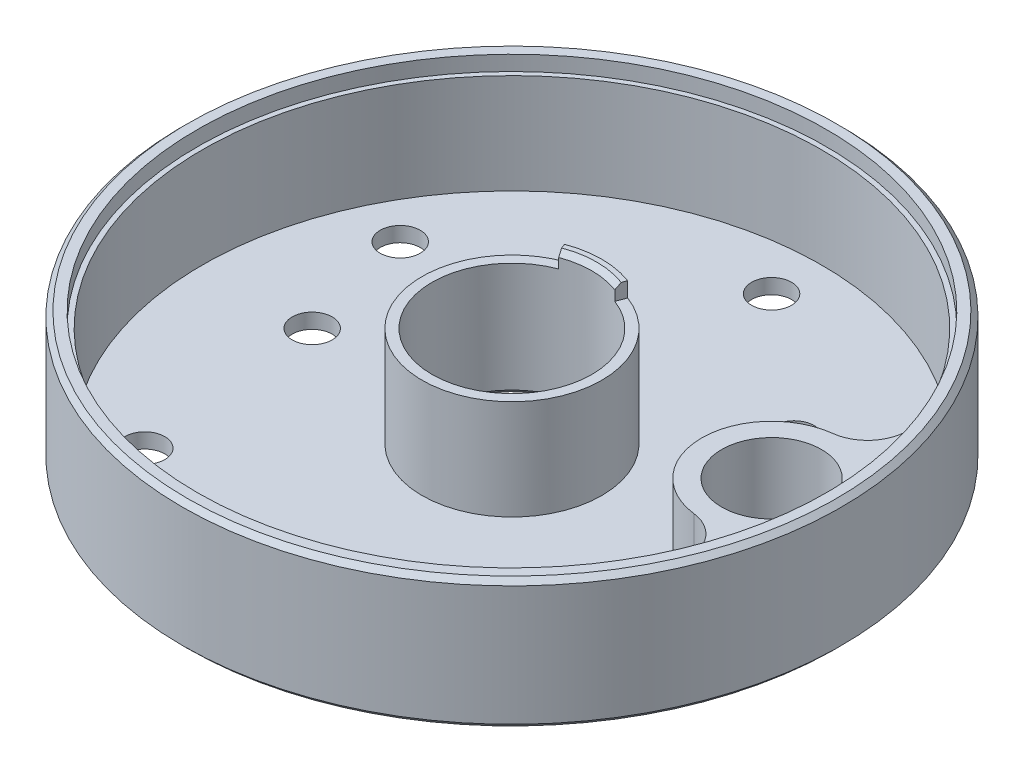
ISO-10303-21;
HEADER;
FILE_DESCRIPTION(('STEP AP214'),'2;1');
FILE_NAME('part.step','',(''),(''),'','','');
FILE_SCHEMA(('AUTOMOTIVE_DESIGN { 1 0 10303 214 1 1 1 1 }'));
ENDSEC;
DATA;
#1=APPLICATION_CONTEXT('core data for automotive mechanical design processes');
#2=APPLICATION_PROTOCOL_DEFINITION('international standard','automotive_design',2000,#1);
#3=PRODUCT_CONTEXT('',#1,'mechanical');
#4=PRODUCT('Part','Part','',(#3));
#5=PRODUCT_RELATED_PRODUCT_CATEGORY('part','',(#4));
#6=PRODUCT_DEFINITION_FORMATION('','',#4);
#7=PRODUCT_DEFINITION_CONTEXT('part definition',#1,'design');
#8=PRODUCT_DEFINITION('design','',#6,#7);
#9=PRODUCT_DEFINITION_SHAPE('','',#8);
#10=(LENGTH_UNIT() NAMED_UNIT(*) SI_UNIT(.MILLI.,.METRE.));
#11=(NAMED_UNIT(*) PLANE_ANGLE_UNIT() SI_UNIT($,.RADIAN.));
#12=(NAMED_UNIT(*) SI_UNIT($,.STERADIAN.) SOLID_ANGLE_UNIT());
#13=UNCERTAINTY_MEASURE_WITH_UNIT(LENGTH_MEASURE(1.E-05),#10,'distance_accuracy_value','');
#14=(GEOMETRIC_REPRESENTATION_CONTEXT(3) GLOBAL_UNCERTAINTY_ASSIGNED_CONTEXT((#13)) GLOBAL_UNIT_ASSIGNED_CONTEXT((#10,
#11,#12)) REPRESENTATION_CONTEXT('',''));
#15=CARTESIAN_POINT('',(0.,0.,0.));
#16=DIRECTION('',(0.,0.,1.));
#17=DIRECTION('',(1.,0.,0.));
#18=AXIS2_PLACEMENT_3D('',#15,#16,#17);
#19=CARTESIAN_POINT('',(0.,-1.5,0.));
#20=DIRECTION('',(0.,1.,0.));
#21=DIRECTION('',(0.,0.,1.));
#22=AXIS2_PLACEMENT_3D('',#19,#20,#21);
#23=PLANE('',#22);
#24=DIRECTION('',(0.351123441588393,0.,0.936329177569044));
#25=VECTOR('',#24,1.);
#26=CARTESIAN_POINT('',(-3.,-1.5,-8.));
#27=LINE('',#26,#25);
#28=CARTESIAN_POINT('',(-3.16011097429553,-1.5,-8.4269625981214));
#29=VERTEX_POINT('',#28);
#30=CARTESIAN_POINT('',(-2.80898753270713,-1.5,-7.49063342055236));
#31=VERTEX_POINT('',#30);
#32=EDGE_CURVE('E163',#29,#31,#27,.T.);
#33=ORIENTED_EDGE('',*,*,#32,.F.);
#34=CARTESIAN_POINT('',(0.,-1.5,0.));
#35=DIRECTION('',(0.,1.,0.));
#36=DIRECTION('',(0.,0.,1.));
#37=AXIS2_PLACEMENT_3D('',#34,#35,#36);
#38=CIRCLE('',#37,9.);
#39=CARTESIAN_POINT('',(3.16011097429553,-1.5,-8.4269625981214));
#40=VERTEX_POINT('',#39);
#41=EDGE_CURVE('E137',#29,#40,#38,.T.);
#42=ORIENTED_EDGE('',*,*,#41,.T.);
#43=DIRECTION('',(0.351123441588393,0.,-0.936329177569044));
#44=VECTOR('',#43,1.);
#45=CARTESIAN_POINT('',(3.,-1.5,-8.));
#46=LINE('',#45,#44);
#47=CARTESIAN_POINT('',(2.80898753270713,-1.5,-7.49063342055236));
#48=VERTEX_POINT('',#47);
#49=EDGE_CURVE('E160',#48,#40,#46,.T.);
#50=ORIENTED_EDGE('',*,*,#49,.F.);
#51=CARTESIAN_POINT('',(0.,-1.5,0.));
#52=DIRECTION('',(0.,1.,0.));
#53=DIRECTION('',(0.,0.,1.));
#54=AXIS2_PLACEMENT_3D('',#51,#52,#53);
#55=CIRCLE('',#54,8.);
#56=EDGE_CURVE('E166',#31,#48,#55,.T.);
#57=ORIENTED_EDGE('',*,*,#56,.F.);
#58=EDGE_LOOP('',(#33,#42,#50,#57));
#59=FACE_BOUND('',#58,.T.);
#60=ADVANCED_FACE('F32',(#59),#23,.T.);
#61=CARTESIAN_POINT('',(0.,0.,0.));
#62=DIRECTION('',(0.,1.,0.));
#63=DIRECTION('',(0.,0.,1.));
#64=AXIS2_PLACEMENT_3D('',#61,#62,#63);
#65=PLANE('',#64);
#66=DIRECTION('',(0.351123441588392,0.,0.936329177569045));
#67=VECTOR('',#66,1.);
#68=CARTESIAN_POINT('',(-2.80898753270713,0.,-7.49063342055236));
#69=LINE('',#68,#67);
#70=CARTESIAN_POINT('',(-3.16011097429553,0.,-8.4269625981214));
#71=VERTEX_POINT('',#70);
#72=CARTESIAN_POINT('',(-2.98454925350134,0.,-7.95879800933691));
#73=VERTEX_POINT('',#72);
#74=EDGE_CURVE('E172',#71,#73,#69,.T.);
#75=ORIENTED_EDGE('',*,*,#74,.T.);
#76=CARTESIAN_POINT('',(0.,0.,0.));
#77=DIRECTION('',(0.,1.,0.));
#78=DIRECTION('',(0.,0.,1.));
#79=AXIS2_PLACEMENT_3D('',#76,#77,#78);
#80=CIRCLE('',#79,8.50000000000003);
#81=CARTESIAN_POINT('',(2.98454925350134,0.,-7.95879800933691));
#82=VERTEX_POINT('',#81);
#83=EDGE_CURVE('E47',#73,#82,#80,.F.);
#84=ORIENTED_EDGE('',*,*,#83,.T.);
#85=DIRECTION('',(0.351123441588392,0.,-0.936329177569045));
#86=VECTOR('',#85,1.);
#87=CARTESIAN_POINT('',(2.80898753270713,0.,-7.49063342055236));
#88=LINE('',#87,#86);
#89=CARTESIAN_POINT('',(3.16011097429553,0.,-8.4269625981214));
#90=VERTEX_POINT('',#89);
#91=EDGE_CURVE('E164',#82,#90,#88,.T.);
#92=ORIENTED_EDGE('',*,*,#91,.T.);
#93=CARTESIAN_POINT('',(0.,0.,0.));
#94=DIRECTION('',(0.,1.,0.));
#95=DIRECTION('',(0.,0.,1.));
#96=AXIS2_PLACEMENT_3D('',#93,#94,#95);
#97=CIRCLE('',#96,9.);
#98=EDGE_CURVE('E157',#90,#71,#97,.T.);
#99=ORIENTED_EDGE('',*,*,#98,.T.);
#100=EDGE_LOOP('',(#75,#84,#92,#99));
#101=FACE_BOUND('',#100,.T.);
#102=ADVANCED_FACE('F224',(#101),#65,.T.);
#103=CARTESIAN_POINT('',(0.,-13.,0.));
#104=DIRECTION('',(0.,1.,0.));
#105=DIRECTION('',(0.,0.,1.));
#106=AXIS2_PLACEMENT_3D('',#103,#104,#105);
#107=CYLINDRICAL_SURFACE('',#106,8.);
#108=CARTESIAN_POINT('',(0.,-12.5,0.));
#109=DIRECTION('',(0.,1.,0.));
#110=DIRECTION('',(0.,0.,1.));
#111=AXIS2_PLACEMENT_3D('',#108,#109,#110);
#112=CIRCLE('',#111,8.);
#113=CARTESIAN_POINT('',(0.,-12.5,8.));
#114=VERTEX_POINT('',#113);
#115=EDGE_CURVE('E11',#114,#114,#112,.F.);
#116=ORIENTED_EDGE('',*,*,#115,.T.);
#117=EDGE_LOOP('',(#116));
#118=FACE_BOUND('',#117,.T.);
#119=DIRECTION('',(0.,1.,0.));
#120=VECTOR('',#119,1.);
#121=CARTESIAN_POINT('',(2.80898753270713,-1.5,-7.49063342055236));
#122=LINE('',#121,#120);
#123=CARTESIAN_POINT('',(2.80898753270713,-0.500000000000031,-7.49063342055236));
#124=VERTEX_POINT('',#123);
#125=EDGE_CURVE('E175',#48,#124,#122,.T.);
#126=ORIENTED_EDGE('',*,*,#125,.T.);
#127=CARTESIAN_POINT('',(0.,-0.500000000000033,0.));
#128=DIRECTION('',(0.,1.,0.));
#129=DIRECTION('',(0.,0.,1.));
#130=AXIS2_PLACEMENT_3D('',#127,#128,#129);
#131=CIRCLE('',#130,8.);
#132=CARTESIAN_POINT('',(-2.80898753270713,-0.500000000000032,-7.49063342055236));
#133=VERTEX_POINT('',#132);
#134=EDGE_CURVE('E202',#124,#133,#131,.T.);
#135=ORIENTED_EDGE('',*,*,#134,.T.);
#136=DIRECTION('',(0.,1.,0.));
#137=VECTOR('',#136,1.);
#138=CARTESIAN_POINT('',(-2.80898753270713,-1.5,-7.49063342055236));
#139=LINE('',#138,#137);
#140=EDGE_CURVE('E179',#31,#133,#139,.T.);
#141=ORIENTED_EDGE('',*,*,#140,.F.);
#142=ORIENTED_EDGE('',*,*,#56,.T.);
#143=EDGE_LOOP('',(#126,#135,#141,#142));
#144=FACE_BOUND('',#143,.T.);
#145=ADVANCED_FACE('F231',(#118,#144),#107,.F.);
#146=CARTESIAN_POINT('',(0.,-13.,0.));
#147=DIRECTION('',(0.,1.,0.));
#148=DIRECTION('',(0.,0.,1.));
#149=AXIS2_PLACEMENT_3D('',#146,#147,#148);
#150=CYLINDRICAL_SURFACE('',#149,33.);
#151=CARTESIAN_POINT('',(0.,-12.5,0.));
#152=DIRECTION('',(0.,1.,0.));
#153=DIRECTION('',(0.,0.,1.));
#154=AXIS2_PLACEMENT_3D('',#151,#152,#153);
#155=CIRCLE('',#154,33.);
#156=CARTESIAN_POINT('',(0.,-12.5,33.));
#157=VERTEX_POINT('',#156);
#158=EDGE_CURVE('E193',#157,#157,#155,.T.);
#159=CARTESIAN_POINT('',(0.,-0.499999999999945,0.));
#160=DIRECTION('',(0.,1.,0.));
#161=DIRECTION('',(0.,0.,1.));
#162=AXIS2_PLACEMENT_3D('',#159,#160,#161);
#163=CIRCLE('',#162,33.);
#164=CARTESIAN_POINT('',(0.,-0.499999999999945,33.));
#165=VERTEX_POINT('',#164);
#166=EDGE_CURVE('E188',#165,#165,#163,.F.);
#167=CARTESIAN_POINT('',(0.,-12.5,33.));
#168=CARTESIAN_POINT('',(0.,-12.375,33.));
#169=CARTESIAN_POINT('',(0.,-12.25,33.));
#170=CARTESIAN_POINT('',(0.,-12.,33.));
#171=CARTESIAN_POINT('',(0.,-11.875,33.));
#172=CARTESIAN_POINT('',(0.,-11.625,33.));
#173=CARTESIAN_POINT('',(0.,-11.5,33.));
#174=CARTESIAN_POINT('',(0.,-11.25,33.));
#175=CARTESIAN_POINT('',(0.,-11.125,33.));
#176=CARTESIAN_POINT('',(0.,-10.875,33.));
#177=CARTESIAN_POINT('',(0.,-10.75,33.));
#178=CARTESIAN_POINT('',(0.,-10.5,33.));
#179=CARTESIAN_POINT('',(0.,-10.375,33.));
#180=CARTESIAN_POINT('',(0.,-10.125,33.));
#181=CARTESIAN_POINT('',(0.,-9.99999999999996,33.));
#182=CARTESIAN_POINT('',(0.,-9.74999999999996,33.));
#183=CARTESIAN_POINT('',(0.,-9.62499999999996,33.));
#184=CARTESIAN_POINT('',(0.,-9.37499999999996,33.));
#185=CARTESIAN_POINT('',(0.,-9.24999999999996,33.));
#186=CARTESIAN_POINT('',(0.,-8.99999999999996,33.));
#187=CARTESIAN_POINT('',(0.,-8.87499999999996,33.));
#188=CARTESIAN_POINT('',(0.,-8.62499999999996,33.));
#189=CARTESIAN_POINT('',(0.,-8.49999999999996,33.));
#190=CARTESIAN_POINT('',(0.,-8.24999999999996,33.));
#191=CARTESIAN_POINT('',(0.,-8.12499999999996,33.));
#192=CARTESIAN_POINT('',(0.,-7.87499999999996,33.));
#193=CARTESIAN_POINT('',(0.,-7.74999999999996,33.));
#194=CARTESIAN_POINT('',(0.,-7.49999999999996,33.));
#195=CARTESIAN_POINT('',(0.,-7.37499999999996,33.));
#196=CARTESIAN_POINT('',(0.,-7.12499999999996,33.));
#197=CARTESIAN_POINT('',(0.,-6.99999999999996,33.));
#198=CARTESIAN_POINT('',(0.,-6.74999999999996,33.));
#199=CARTESIAN_POINT('',(0.,-6.62499999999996,33.));
#200=CARTESIAN_POINT('',(0.,-6.37499999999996,33.));
#201=CARTESIAN_POINT('',(0.,-6.24999999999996,33.));
#202=CARTESIAN_POINT('',(0.,-5.99999999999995,33.));
#203=CARTESIAN_POINT('',(0.,-5.87499999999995,33.));
#204=CARTESIAN_POINT('',(0.,-5.62499999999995,33.));
#205=CARTESIAN_POINT('',(0.,-5.49999999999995,33.));
#206=CARTESIAN_POINT('',(0.,-5.24999999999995,33.));
#207=CARTESIAN_POINT('',(0.,-5.12499999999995,33.));
#208=CARTESIAN_POINT('',(0.,-4.87499999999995,33.));
#209=CARTESIAN_POINT('',(0.,-4.74999999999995,33.));
#210=CARTESIAN_POINT('',(0.,-4.49999999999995,33.));
#211=CARTESIAN_POINT('',(0.,-4.37499999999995,33.));
#212=CARTESIAN_POINT('',(0.,-4.12499999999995,33.));
#213=CARTESIAN_POINT('',(0.,-3.99999999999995,33.));
#214=CARTESIAN_POINT('',(0.,-3.74999999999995,33.));
#215=CARTESIAN_POINT('',(0.,-3.62499999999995,33.));
#216=CARTESIAN_POINT('',(0.,-3.37499999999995,33.));
#217=CARTESIAN_POINT('',(0.,-3.24999999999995,33.));
#218=CARTESIAN_POINT('',(0.,-2.99999999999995,33.));
#219=CARTESIAN_POINT('',(0.,-2.87499999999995,33.));
#220=CARTESIAN_POINT('',(0.,-2.62499999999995,33.));
#221=CARTESIAN_POINT('',(0.,-2.49999999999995,33.));
#222=CARTESIAN_POINT('',(0.,-2.24999999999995,33.));
#223=CARTESIAN_POINT('',(0.,-2.12499999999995,33.));
#224=CARTESIAN_POINT('',(0.,-1.87499999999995,33.));
#225=CARTESIAN_POINT('',(0.,-1.74999999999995,33.));
#226=CARTESIAN_POINT('',(0.,-1.49999999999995,33.));
#227=CARTESIAN_POINT('',(0.,-1.37499999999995,33.));
#228=CARTESIAN_POINT('',(0.,-1.12499999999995,33.));
#229=CARTESIAN_POINT('',(0.,-0.999999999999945,33.));
#230=CARTESIAN_POINT('',(0.,-0.749999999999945,33.));
#231=CARTESIAN_POINT('',(0.,-0.624999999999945,33.));
#232=CARTESIAN_POINT('',(0.,-0.499999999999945,33.));
#233=B_SPLINE_CURVE_WITH_KNOTS('',3,(#167,#168,#169,#170,#171,#172,#173,#174,#175,#176,#177,
#178,#179,#180,#181,#182,#183,#184,#185,#186,#187,#188,#189,#190,#191,#192,#193,#194,#195,#196,
#197,#198,#199,#200,#201,#202,#203,#204,#205,#206,#207,#208,#209,#210,#211,#212,#213,#214,#215,
#216,#217,#218,#219,#220,#221,#222,#223,#224,#225,#226,#227,#228,#229,#230,#231,#232),
.UNSPECIFIED.,.F.,.F.,(4,2,2,2,2,2,2,2,2,2,2,2,2,2,2,2,2,2,2,2,2,2,2,2,2,2,2,2,2,2,2,2,4),(0.,
0.375,0.750000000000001,1.125,1.5,1.875,2.25,2.625,3.,3.375,3.75,4.12500000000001,
4.50000000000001,4.87500000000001,5.25000000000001,5.62500000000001,6.00000000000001,
6.37500000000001,6.75000000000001,7.12500000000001,7.50000000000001,7.87500000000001,
8.25000000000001,8.62500000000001,9.00000000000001,9.37500000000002,9.75000000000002,10.125,
10.5,10.875,11.25,11.625,12.),.UNSPECIFIED.);
#234=EDGE_CURVE('BSEAM262',#157,#165,#233,.T.);
#235=ORIENTED_EDGE('',*,*,#158,.T.);
#236=ORIENTED_EDGE('',*,*,#166,.T.);
#237=ORIENTED_EDGE('',*,*,#234,.T.);
#238=ORIENTED_EDGE('',*,*,#234,.F.);
#239=EDGE_LOOP('',(#235,#237,#236,#238));
#240=FACE_BOUND('',#239,.T.);
#241=ADVANCED_FACE('F262',(#240),#150,.T.);
#242=CARTESIAN_POINT('',(0.,-13.,0.));
#243=DIRECTION('',(0.,1.,0.));
#244=DIRECTION('',(0.,0.,1.));
#245=AXIS2_PLACEMENT_3D('',#242,#243,#244);
#246=PLANE('',#245);
#247=CARTESIAN_POINT('',(0.,-13.,0.));
#248=DIRECTION('',(0.,1.,0.));
#249=DIRECTION('',(0.,0.,1.));
#250=AXIS2_PLACEMENT_3D('',#247,#248,#249);
#251=CIRCLE('',#250,8.49999999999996);
#252=CARTESIAN_POINT('',(0.,-13.,8.49999999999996));
#253=VERTEX_POINT('',#252);
#254=EDGE_CURVE('E40',#253,#253,#251,.T.);
#255=ORIENTED_EDGE('',*,*,#254,.T.);
#256=EDGE_LOOP('',(#255));
#257=FACE_BOUND('',#256,.T.);
#258=CARTESIAN_POINT('',(0.,-13.,0.));
#259=DIRECTION('',(0.,1.,0.));
#260=DIRECTION('',(0.,0.,1.));
#261=AXIS2_PLACEMENT_3D('',#258,#259,#260);
#262=CIRCLE('',#261,32.5);
#263=CARTESIAN_POINT('',(0.,-13.,32.5));
#264=VERTEX_POINT('',#263);
#265=EDGE_CURVE('E196',#264,#264,#262,.F.);
#266=ORIENTED_EDGE('',*,*,#265,.T.);
#267=EDGE_LOOP('',(#266));
#268=FACE_BOUND('',#267,.T.);
#269=CARTESIAN_POINT('',(-23.1061777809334,-13.,-11.9207612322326));
#270=DIRECTION('',(0.,1.,0.));
#271=DIRECTION('',(0.,0.,1.));
#272=AXIS2_PLACEMENT_3D('',#269,#270,#271);
#273=CIRCLE('',#272,2.);
#274=CARTESIAN_POINT('',(-23.1061777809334,-13.,-9.92076123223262));
#275=VERTEX_POINT('',#274);
#276=EDGE_CURVE('E559',#275,#275,#273,.T.);
#277=ORIENTED_EDGE('',*,*,#276,.T.);
#278=EDGE_LOOP('',(#277));
#279=FACE_BOUND('',#278,.T.);
#280=CARTESIAN_POINT('',(-9.87818285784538,-13.,-9.92076123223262));
#281=DIRECTION('',(0.,1.,0.));
#282=DIRECTION('',(0.,0.,1.));
#283=AXIS2_PLACEMENT_3D('',#280,#281,#282);
#284=CIRCLE('',#283,5.);
#285=CARTESIAN_POINT('',(-9.87818285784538,-13.,-4.92076123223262));
#286=VERTEX_POINT('',#285);
#287=EDGE_CURVE('E554',#286,#286,#284,.T.);
#288=ORIENTED_EDGE('',*,*,#287,.T.);
#289=EDGE_LOOP('',(#288));
#290=FACE_BOUND('',#289,.T.);
#291=CARTESIAN_POINT('',(13.5513466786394,-13.,-14.7092149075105));
#292=DIRECTION('',(0.,1.,0.));
#293=DIRECTION('',(0.,0.,1.));
#294=AXIS2_PLACEMENT_3D('',#291,#292,#293);
#295=CIRCLE('',#294,2.);
#296=CARTESIAN_POINT('',(13.5513466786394,-13.,-12.7092149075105));
#297=VERTEX_POINT('',#296);
#298=EDGE_CURVE('E548',#297,#297,#295,.T.);
#299=ORIENTED_EDGE('',*,*,#298,.T.);
#300=EDGE_LOOP('',(#299));
#301=FACE_BOUND('',#300,.T.);
#302=CARTESIAN_POINT('',(18.,-13.,18.7616630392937));
#303=DIRECTION('',(0.,1.,0.));
#304=DIRECTION('',(0.,0.,1.));
#305=AXIS2_PLACEMENT_3D('',#302,#303,#304);
#306=CIRCLE('',#305,2.);
#307=CARTESIAN_POINT('',(18.,-13.,20.7616630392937));
#308=VERTEX_POINT('',#307);
#309=EDGE_CURVE('E542',#308,#308,#306,.T.);
#310=ORIENTED_EDGE('',*,*,#309,.T.);
#311=EDGE_LOOP('',(#310));
#312=FACE_BOUND('',#311,.T.);
#313=CARTESIAN_POINT('',(-18.,-13.,18.7616630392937));
#314=DIRECTION('',(0.,1.,0.));
#315=DIRECTION('',(0.,0.,1.));
#316=AXIS2_PLACEMENT_3D('',#313,#314,#315);
#317=CIRCLE('',#316,2.);
#318=CARTESIAN_POINT('',(-18.,-13.,20.7616630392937));
#319=VERTEX_POINT('',#318);
#320=EDGE_CURVE('E536',#319,#319,#317,.T.);
#321=ORIENTED_EDGE('',*,*,#320,.T.);
#322=EDGE_LOOP('',(#321));
#323=FACE_BOUND('',#322,.T.);
#324=CARTESIAN_POINT('',(5.56220041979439,-13.,19.2109845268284));
#325=DIRECTION('',(0.,1.,0.));
#326=DIRECTION('',(0.,0.,1.));
#327=AXIS2_PLACEMENT_3D('',#324,#325,#326);
#328=CIRCLE('',#327,2.);
#329=CARTESIAN_POINT('',(5.56220041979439,-13.,21.2109845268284));
#330=VERTEX_POINT('',#329);
#331=EDGE_CURVE('E530',#330,#330,#328,.T.);
#332=ORIENTED_EDGE('',*,*,#331,.T.);
#333=EDGE_LOOP('',(#332));
#334=FACE_BOUND('',#333,.T.);
#335=CARTESIAN_POINT('',(-20.,-13.,0.));
#336=DIRECTION('',(0.,1.,0.));
#337=DIRECTION('',(0.,0.,1.));
#338=AXIS2_PLACEMENT_3D('',#335,#336,#337);
#339=CIRCLE('',#338,2.);
#340=CARTESIAN_POINT('',(-20.,-13.,2.));
#341=VERTEX_POINT('',#340);
#342=EDGE_CURVE('E524',#341,#341,#339,.T.);
#343=ORIENTED_EDGE('',*,*,#342,.T.);
#344=EDGE_LOOP('',(#343));
#345=FACE_BOUND('',#344,.T.);
#346=CARTESIAN_POINT('',(0.,-13.,-26.));
#347=DIRECTION('',(0.,1.,0.));
#348=DIRECTION('',(0.,0.,1.));
#349=AXIS2_PLACEMENT_3D('',#346,#347,#348);
#350=CIRCLE('',#349,2.);
#351=CARTESIAN_POINT('',(0.,-13.,-24.));
#352=VERTEX_POINT('',#351);
#353=EDGE_CURVE('E519',#352,#352,#350,.T.);
#354=ORIENTED_EDGE('',*,*,#353,.T.);
#355=EDGE_LOOP('',(#354));
#356=FACE_BOUND('',#355,.T.);
#357=CARTESIAN_POINT('',(26.,-13.,0.));
#358=DIRECTION('',(0.,1.,0.));
#359=DIRECTION('',(0.,0.,1.));
#360=AXIS2_PLACEMENT_3D('',#357,#358,#359);
#361=CIRCLE('',#360,5.);
#362=CARTESIAN_POINT('',(26.,-13.,5.));
#363=VERTEX_POINT('',#362);
#364=EDGE_CURVE('E154',#363,#363,#361,.T.);
#365=ORIENTED_EDGE('',*,*,#364,.T.);
#366=EDGE_LOOP('',(#365));
#367=FACE_BOUND('',#366,.T.);
#368=ADVANCED_FACE('F211',(#257,#268,#279,#290,#301,#312,#323,#334,#345,#356,#367),#246,.F.);
#369=CARTESIAN_POINT('',(0.,0.,0.));
#370=DIRECTION('',(0.,1.,0.));
#371=DIRECTION('',(0.,0.,1.));
#372=AXIS2_PLACEMENT_3D('',#369,#370,#371);
#373=CIRCLE('',#372,32.5);
#374=CARTESIAN_POINT('',(0.,0.,32.5));
#375=VERTEX_POINT('',#374);
#376=EDGE_CURVE('E199',#375,#375,#373,.T.);
#377=ORIENTED_EDGE('',*,*,#376,.T.);
#378=EDGE_LOOP('',(#377));
#379=FACE_BOUND('',#378,.T.);
#380=CARTESIAN_POINT('',(0.,0.,0.));
#381=DIRECTION('',(0.,1.,0.));
#382=DIRECTION('',(0.,0.,1.));
#383=AXIS2_PLACEMENT_3D('',#380,#381,#382);
#384=CIRCLE('',#383,31.5);
#385=CARTESIAN_POINT('',(0.,0.,31.5));
#386=VERTEX_POINT('',#385);
#387=EDGE_CURVE('E178',#386,#386,#384,.T.);
#388=ORIENTED_EDGE('',*,*,#387,.F.);
#389=EDGE_LOOP('',(#388));
#390=FACE_BOUND('',#389,.T.);
#391=ADVANCED_FACE('F233',(#379,#390),#65,.T.);
#392=CARTESIAN_POINT('',(0.,-1.5,0.));
#393=DIRECTION('',(0.,1.,0.));
#394=DIRECTION('',(0.,0.,1.));
#395=AXIS2_PLACEMENT_3D('',#392,#393,#394);
#396=CYLINDRICAL_SURFACE('',#395,31.5);
#397=CARTESIAN_POINT('',(0.,-1.5,0.));
#398=DIRECTION('',(0.,1.,0.));
#399=DIRECTION('',(0.,0.,1.));
#400=AXIS2_PLACEMENT_3D('',#397,#398,#399);
#401=CIRCLE('',#400,31.5);
#402=CARTESIAN_POINT('',(0.,-1.5,31.5));
#403=VERTEX_POINT('',#402);
#404=EDGE_CURVE('E185',#403,#403,#401,.T.);
#405=ORIENTED_EDGE('',*,*,#404,.F.);
#406=EDGE_LOOP('',(#405));
#407=FACE_BOUND('',#406,.T.);
#408=ORIENTED_EDGE('',*,*,#387,.T.);
#409=EDGE_LOOP('',(#408));
#410=FACE_BOUND('',#409,.T.);
#411=ADVANCED_FACE('F239',(#407,#410),#396,.F.);
#412=CARTESIAN_POINT('',(24.6923076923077,-1.5,10.9219934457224));
#413=DIRECTION('',(0.,1.,0.));
#414=DIRECTION('',(0.,0.,-1.));
#415=AXIS2_PLACEMENT_3D('',#412,#413,#414);
#416=CIRCLE('',#415,4.);
#417=CARTESIAN_POINT('',(28.3504273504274,-1.5,12.5400665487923));
#418=VERTEX_POINT('',#417);
#419=CARTESIAN_POINT('',(25.1678321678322,-1.5,6.95035946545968));
#420=VERTEX_POINT('',#419);
#421=EDGE_CURVE('E114',#418,#420,#416,.T.);
#422=ORIENTED_EDGE('',*,*,#421,.F.);
#423=CARTESIAN_POINT('',(0.,-1.5,0.));
#424=DIRECTION('',(0.,1.,0.));
#425=DIRECTION('',(0.,0.,1.));
#426=AXIS2_PLACEMENT_3D('',#423,#424,#425);
#427=CIRCLE('',#426,31.);
#428=CARTESIAN_POINT('',(28.3504273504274,-1.5,-12.5400665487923));
#429=VERTEX_POINT('',#428);
#430=EDGE_CURVE('E131',#429,#418,#427,.T.);
#431=ORIENTED_EDGE('',*,*,#430,.F.);
#432=CARTESIAN_POINT('',(24.6923076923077,-1.5,-10.9219934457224));
#433=DIRECTION('',(0.,1.,0.));
#434=DIRECTION('',(0.,0.,1.));
#435=AXIS2_PLACEMENT_3D('',#432,#433,#434);
#436=CIRCLE('',#435,4.);
#437=CARTESIAN_POINT('',(25.1678321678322,-1.5,-6.95035946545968));
#438=VERTEX_POINT('',#437);
#439=EDGE_CURVE('E134',#438,#429,#436,.T.);
#440=ORIENTED_EDGE('',*,*,#439,.F.);
#441=CARTESIAN_POINT('',(26.,-1.5,0.));
#442=DIRECTION('',(0.,-1.,0.));
#443=DIRECTION('',(0.,0.,1.));
#444=AXIS2_PLACEMENT_3D('',#441,#442,#443);
#445=CIRCLE('',#444,6.99999999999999);
#446=EDGE_CURVE('E143',#420,#438,#445,.T.);
#447=ORIENTED_EDGE('',*,*,#446,.F.);
#448=EDGE_LOOP('',(#422,#431,#440,#447));
#449=FACE_BOUND('',#448,.T.);
#450=CARTESIAN_POINT('',(26.,-1.5,0.));
#451=DIRECTION('',(0.,1.,0.));
#452=DIRECTION('',(0.,0.,1.));
#453=AXIS2_PLACEMENT_3D('',#450,#451,#452);
#454=CIRCLE('',#453,5.);
#455=CARTESIAN_POINT('',(26.,-1.5,5.));
#456=VERTEX_POINT('',#455);
#457=EDGE_CURVE('E150',#456,#456,#454,.T.);
#458=ORIENTED_EDGE('',*,*,#457,.F.);
#459=EDGE_LOOP('',(#458));
#460=FACE_BOUND('',#459,.T.);
#461=ORIENTED_EDGE('',*,*,#404,.T.);
#462=EDGE_LOOP('',(#461));
#463=FACE_BOUND('',#462,.T.);
#464=ADVANCED_FACE('F227',(#449,#460,#463),#23,.T.);
#465=CARTESIAN_POINT('',(2.80898753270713,-1.5,-7.49063342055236));
#466=DIRECTION('',(0.936329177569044,0.,0.351123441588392));
#467=DIRECTION('',(0.351123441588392,0.,-0.936329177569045));
#468=AXIS2_PLACEMENT_3D('',#465,#466,#467);
#469=PLANE('',#468);
#470=ORIENTED_EDGE('',*,*,#91,.F.);
#471=DIRECTION('',(0.24828176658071,0.707106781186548,-0.662084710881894));
#472=VECTOR('',#471,1.);
#473=CARTESIAN_POINT('',(0.,-8.50000000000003,0.));
#474=LINE('',#473,#472);
#475=EDGE_CURVE('E207',#82,#124,#474,.F.);
#476=ORIENTED_EDGE('',*,*,#475,.T.);
#477=ORIENTED_EDGE('',*,*,#125,.F.);
#478=ORIENTED_EDGE('',*,*,#49,.T.);
#479=DIRECTION('',(0.,1.,0.));
#480=VECTOR('',#479,1.);
#481=CARTESIAN_POINT('',(3.16011097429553,-1.5,-8.4269625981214));
#482=LINE('',#481,#480);
#483=EDGE_CURVE('E169',#40,#90,#482,.T.);
#484=ORIENTED_EDGE('',*,*,#483,.T.);
#485=EDGE_LOOP('',(#470,#476,#477,#478,#484));
#486=FACE_BOUND('',#485,.T.);
#487=ADVANCED_FACE('F238',(#486),#469,.T.);
#488=CARTESIAN_POINT('',(-2.80898753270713,-1.5,-7.49063342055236));
#489=DIRECTION('',(-0.936329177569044,0.,0.351123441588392));
#490=DIRECTION('',(0.351123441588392,0.,0.936329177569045));
#491=AXIS2_PLACEMENT_3D('',#488,#489,#490);
#492=PLANE('',#491);
#493=ORIENTED_EDGE('',*,*,#140,.T.);
#494=DIRECTION('',(0.24828176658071,-0.707106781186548,0.662084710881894));
#495=VECTOR('',#494,1.);
#496=CARTESIAN_POINT('',(0.,-8.50000000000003,0.));
#497=LINE('',#496,#495);
#498=EDGE_CURVE('E55',#133,#73,#497,.F.);
#499=ORIENTED_EDGE('',*,*,#498,.T.);
#500=ORIENTED_EDGE('',*,*,#74,.F.);
#501=DIRECTION('',(0.,1.,0.));
#502=VECTOR('',#501,1.);
#503=CARTESIAN_POINT('',(-3.16011097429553,-1.5,-8.4269625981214));
#504=LINE('',#503,#502);
#505=EDGE_CURVE('E181',#29,#71,#504,.T.);
#506=ORIENTED_EDGE('',*,*,#505,.F.);
#507=ORIENTED_EDGE('',*,*,#32,.T.);
#508=EDGE_LOOP('',(#493,#499,#500,#506,#507));
#509=FACE_BOUND('',#508,.T.);
#510=ADVANCED_FACE('F245',(#509),#492,.T.);
#511=CARTESIAN_POINT('',(0.,-1.5,0.));
#512=DIRECTION('',(0.,1.,0.));
#513=DIRECTION('',(0.,0.,1.));
#514=AXIS2_PLACEMENT_3D('',#511,#512,#513);
#515=CYLINDRICAL_SURFACE('',#514,9.);
#516=ORIENTED_EDGE('',*,*,#98,.F.);
#517=ORIENTED_EDGE('',*,*,#483,.F.);
#518=ORIENTED_EDGE('',*,*,#41,.F.);
#519=ORIENTED_EDGE('',*,*,#505,.T.);
#520=EDGE_LOOP('',(#516,#517,#518,#519));
#521=FACE_BOUND('',#520,.T.);
#522=CARTESIAN_POINT('',(0.,-11.5,0.));
#523=DIRECTION('',(0.,1.,0.));
#524=DIRECTION('',(0.,0.,1.));
#525=AXIS2_PLACEMENT_3D('',#522,#523,#524);
#526=CIRCLE('',#525,9.);
#527=CARTESIAN_POINT('',(-6.35026040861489,-11.5,-6.37763222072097));
#528=VERTEX_POINT('',#527);
#529=EDGE_CURVE('E144',#528,#528,#526,.T.);
#530=ORIENTED_EDGE('',*,*,#529,.T.);
#531=EDGE_LOOP('',(#530));
#532=FACE_BOUND('',#531,.T.);
#533=ADVANCED_FACE('F337',(#521,#532),#515,.T.);
#534=CARTESIAN_POINT('',(26.,-13.,0.));
#535=DIRECTION('',(0.,1.,0.));
#536=DIRECTION('',(0.,0.,1.));
#537=AXIS2_PLACEMENT_3D('',#534,#535,#536);
#538=CYLINDRICAL_SURFACE('',#537,5.);
#539=ORIENTED_EDGE('',*,*,#364,.F.);
#540=EDGE_LOOP('',(#539));
#541=FACE_BOUND('',#540,.T.);
#542=ORIENTED_EDGE('',*,*,#457,.T.);
#543=EDGE_LOOP('',(#542));
#544=FACE_BOUND('',#543,.T.);
#545=ADVANCED_FACE('F459',(#541,#544),#538,.F.);
#546=CARTESIAN_POINT('',(24.6923076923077,-11.5,10.9219934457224));
#547=DIRECTION('',(0.,1.,0.));
#548=DIRECTION('',(0.,0.,1.));
#549=AXIS2_PLACEMENT_3D('',#546,#547,#548);
#550=CYLINDRICAL_SURFACE('',#549,4.);
#551=ORIENTED_EDGE('',*,*,#421,.T.);
#552=DIRECTION('',(0.,1.,0.));
#553=VECTOR('',#552,1.);
#554=CARTESIAN_POINT('',(25.1678321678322,-11.5,6.95035946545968));
#555=LINE('',#554,#553);
#556=CARTESIAN_POINT('',(25.1678321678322,-11.5,6.95035946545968));
#557=VERTEX_POINT('',#556);
#558=EDGE_CURVE('E107',#557,#420,#555,.T.);
#559=ORIENTED_EDGE('',*,*,#558,.F.);
#560=CARTESIAN_POINT('',(24.6923076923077,-11.5,10.9219934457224));
#561=DIRECTION('',(0.,1.,0.));
#562=DIRECTION('',(0.,0.,-1.));
#563=AXIS2_PLACEMENT_3D('',#560,#561,#562);
#564=CIRCLE('',#563,4.);
#565=CARTESIAN_POINT('',(28.3504273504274,-11.5,12.5400665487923));
#566=VERTEX_POINT('',#565);
#567=EDGE_CURVE('E111',#566,#557,#564,.T.);
#568=ORIENTED_EDGE('',*,*,#567,.F.);
#569=DIRECTION('',(0.,1.,0.));
#570=VECTOR('',#569,1.);
#571=CARTESIAN_POINT('',(28.3504273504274,-11.5,12.5400665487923));
#572=LINE('',#571,#570);
#573=EDGE_CURVE('E148',#566,#418,#572,.T.);
#574=ORIENTED_EDGE('',*,*,#573,.T.);
#575=EDGE_LOOP('',(#551,#559,#568,#574));
#576=FACE_BOUND('',#575,.T.);
#577=ADVANCED_FACE('F109',(#576),#550,.F.);
#578=CARTESIAN_POINT('',(0.,-11.5,0.));
#579=DIRECTION('',(0.,1.,0.));
#580=DIRECTION('',(0.,0.,1.));
#581=AXIS2_PLACEMENT_3D('',#578,#579,#580);
#582=CYLINDRICAL_SURFACE('',#581,31.);
#583=ORIENTED_EDGE('',*,*,#430,.T.);
#584=ORIENTED_EDGE('',*,*,#573,.F.);
#585=CARTESIAN_POINT('',(0.,-11.5,0.));
#586=DIRECTION('',(0.,1.,0.));
#587=DIRECTION('',(0.,0.,1.));
#588=AXIS2_PLACEMENT_3D('',#585,#586,#587);
#589=CIRCLE('',#588,31.);
#590=CARTESIAN_POINT('',(28.3504273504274,-11.5,-12.5400665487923));
#591=VERTEX_POINT('',#590);
#592=EDGE_CURVE('E119',#591,#566,#589,.T.);
#593=ORIENTED_EDGE('',*,*,#592,.F.);
#594=DIRECTION('',(0.,1.,0.));
#595=VECTOR('',#594,1.);
#596=CARTESIAN_POINT('',(28.3504273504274,-11.5,-12.5400665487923));
#597=LINE('',#596,#595);
#598=EDGE_CURVE('E151',#591,#429,#597,.T.);
#599=ORIENTED_EDGE('',*,*,#598,.T.);
#600=EDGE_LOOP('',(#583,#584,#593,#599));
#601=FACE_BOUND('',#600,.T.);
#602=ADVANCED_FACE('F442',(#601),#582,.F.);
#603=CARTESIAN_POINT('',(24.6923076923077,-11.5,-10.9219934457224));
#604=DIRECTION('',(0.,1.,0.));
#605=DIRECTION('',(0.,0.,1.));
#606=AXIS2_PLACEMENT_3D('',#603,#604,#605);
#607=CYLINDRICAL_SURFACE('',#606,4.);
#608=ORIENTED_EDGE('',*,*,#439,.T.);
#609=ORIENTED_EDGE('',*,*,#598,.F.);
#610=CARTESIAN_POINT('',(24.6923076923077,-11.5,-10.9219934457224));
#611=DIRECTION('',(0.,1.,0.));
#612=DIRECTION('',(0.,0.,1.));
#613=AXIS2_PLACEMENT_3D('',#610,#611,#612);
#614=CIRCLE('',#613,4.);
#615=CARTESIAN_POINT('',(25.1678321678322,-11.5,-6.95035946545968));
#616=VERTEX_POINT('',#615);
#617=EDGE_CURVE('E127',#616,#591,#614,.T.);
#618=ORIENTED_EDGE('',*,*,#617,.F.);
#619=DIRECTION('',(0.,1.,0.));
#620=VECTOR('',#619,1.);
#621=CARTESIAN_POINT('',(25.1678321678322,-11.5,-6.95035946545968));
#622=LINE('',#621,#620);
#623=EDGE_CURVE('E118',#616,#438,#622,.T.);
#624=ORIENTED_EDGE('',*,*,#623,.T.);
#625=EDGE_LOOP('',(#608,#609,#618,#624));
#626=FACE_BOUND('',#625,.T.);
#627=ADVANCED_FACE('F434',(#626),#607,.F.);
#628=CARTESIAN_POINT('',(26.,-11.5,0.));
#629=DIRECTION('',(0.,1.,0.));
#630=DIRECTION('',(0.,0.,1.));
#631=AXIS2_PLACEMENT_3D('',#628,#629,#630);
#632=CYLINDRICAL_SURFACE('',#631,6.99999999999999);
#633=ORIENTED_EDGE('',*,*,#446,.T.);
#634=ORIENTED_EDGE('',*,*,#623,.F.);
#635=CARTESIAN_POINT('',(26.,-11.5,0.));
#636=DIRECTION('',(0.,-1.,0.));
#637=DIRECTION('',(0.,0.,1.));
#638=AXIS2_PLACEMENT_3D('',#635,#636,#637);
#639=CIRCLE('',#638,6.99999999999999);
#640=EDGE_CURVE('E122',#557,#616,#639,.T.);
#641=ORIENTED_EDGE('',*,*,#640,.F.);
#642=ORIENTED_EDGE('',*,*,#558,.T.);
#643=EDGE_LOOP('',(#633,#634,#641,#642));
#644=FACE_BOUND('',#643,.T.);
#645=ADVANCED_FACE('F123',(#644),#632,.T.);
#646=CARTESIAN_POINT('',(12.3461538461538,-11.5,5.46099672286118));
#647=DIRECTION('',(0.,-1.,0.));
#648=DIRECTION('',(0.,0.,-1.));
#649=AXIS2_PLACEMENT_3D('',#646,#647,#648);
#650=PLANE('',#649);
#651=CARTESIAN_POINT('',(-23.1061777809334,-11.5,-11.9207612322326));
#652=DIRECTION('',(0.,1.,0.));
#653=DIRECTION('',(0.,0.,1.));
#654=AXIS2_PLACEMENT_3D('',#651,#652,#653);
#655=CIRCLE('',#654,2.);
#656=CARTESIAN_POINT('',(-23.1061777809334,-11.5,-9.92076123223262));
#657=VERTEX_POINT('',#656);
#658=EDGE_CURVE('E562',#657,#657,#655,.T.);
#659=ORIENTED_EDGE('',*,*,#658,.F.);
#660=EDGE_LOOP('',(#659));
#661=FACE_BOUND('',#660,.T.);
#662=CARTESIAN_POINT('',(13.5513466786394,-11.5,-14.7092149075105));
#663=DIRECTION('',(0.,1.,0.));
#664=DIRECTION('',(0.,0.,1.));
#665=AXIS2_PLACEMENT_3D('',#662,#663,#664);
#666=CIRCLE('',#665,2.);
#667=CARTESIAN_POINT('',(13.5513466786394,-11.5,-12.7092149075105));
#668=VERTEX_POINT('',#667);
#669=EDGE_CURVE('E551',#668,#668,#666,.T.);
#670=ORIENTED_EDGE('',*,*,#669,.F.);
#671=EDGE_LOOP('',(#670));
#672=FACE_BOUND('',#671,.T.);
#673=CARTESIAN_POINT('',(18.,-11.5,18.7616630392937));
#674=DIRECTION('',(0.,1.,0.));
#675=DIRECTION('',(0.,0.,1.));
#676=AXIS2_PLACEMENT_3D('',#673,#674,#675);
#677=CIRCLE('',#676,2.);
#678=CARTESIAN_POINT('',(18.,-11.5,20.7616630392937));
#679=VERTEX_POINT('',#678);
#680=EDGE_CURVE('E545',#679,#679,#677,.T.);
#681=ORIENTED_EDGE('',*,*,#680,.F.);
#682=EDGE_LOOP('',(#681));
#683=FACE_BOUND('',#682,.T.);
#684=CARTESIAN_POINT('',(-18.,-11.5,18.7616630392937));
#685=DIRECTION('',(0.,1.,0.));
#686=DIRECTION('',(0.,0.,1.));
#687=AXIS2_PLACEMENT_3D('',#684,#685,#686);
#688=CIRCLE('',#687,2.);
#689=CARTESIAN_POINT('',(-18.,-11.5,20.7616630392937));
#690=VERTEX_POINT('',#689);
#691=EDGE_CURVE('E539',#690,#690,#688,.T.);
#692=ORIENTED_EDGE('',*,*,#691,.F.);
#693=EDGE_LOOP('',(#692));
#694=FACE_BOUND('',#693,.T.);
#695=CARTESIAN_POINT('',(5.56220041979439,-11.5,19.2109845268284));
#696=DIRECTION('',(0.,1.,0.));
#697=DIRECTION('',(0.,0.,1.));
#698=AXIS2_PLACEMENT_3D('',#695,#696,#697);
#699=CIRCLE('',#698,2.);
#700=CARTESIAN_POINT('',(5.56220041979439,-11.5,21.2109845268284));
#701=VERTEX_POINT('',#700);
#702=EDGE_CURVE('E533',#701,#701,#699,.T.);
#703=ORIENTED_EDGE('',*,*,#702,.F.);
#704=EDGE_LOOP('',(#703));
#705=FACE_BOUND('',#704,.T.);
#706=CARTESIAN_POINT('',(-20.,-11.5,0.));
#707=DIRECTION('',(0.,1.,0.));
#708=DIRECTION('',(0.,0.,1.));
#709=AXIS2_PLACEMENT_3D('',#706,#707,#708);
#710=CIRCLE('',#709,2.);
#711=CARTESIAN_POINT('',(-20.,-11.5,2.));
#712=VERTEX_POINT('',#711);
#713=EDGE_CURVE('E527',#712,#712,#710,.T.);
#714=ORIENTED_EDGE('',*,*,#713,.F.);
#715=EDGE_LOOP('',(#714));
#716=FACE_BOUND('',#715,.T.);
#717=CARTESIAN_POINT('',(0.,-11.5,-26.));
#718=DIRECTION('',(0.,1.,0.));
#719=DIRECTION('',(0.,0.,1.));
#720=AXIS2_PLACEMENT_3D('',#717,#718,#719);
#721=CIRCLE('',#720,2.);
#722=CARTESIAN_POINT('',(0.,-11.5,-24.));
#723=VERTEX_POINT('',#722);
#724=EDGE_CURVE('E521',#723,#723,#721,.T.);
#725=ORIENTED_EDGE('',*,*,#724,.F.);
#726=EDGE_LOOP('',(#725));
#727=FACE_BOUND('',#726,.T.);
#728=ORIENTED_EDGE('',*,*,#529,.F.);
#729=CARTESIAN_POINT('',(-9.87818285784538,-11.5,-9.92076123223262));
#730=DIRECTION('',(0.,1.,0.));
#731=DIRECTION('',(0.,0.,1.));
#732=AXIS2_PLACEMENT_3D('',#729,#730,#731);
#733=CIRCLE('',#732,5.);
#734=EDGE_CURVE('E557',#528,#528,#733,.T.);
#735=ORIENTED_EDGE('',*,*,#734,.F.);
#736=EDGE_LOOP('',(#728,#735));
#737=FACE_BOUND('',#736,.T.);
#738=ORIENTED_EDGE('',*,*,#567,.T.);
#739=ORIENTED_EDGE('',*,*,#640,.T.);
#740=ORIENTED_EDGE('',*,*,#617,.T.);
#741=ORIENTED_EDGE('',*,*,#592,.T.);
#742=EDGE_LOOP('',(#738,#739,#740,#741));
#743=FACE_BOUND('',#742,.T.);
#744=ADVANCED_FACE('F129',(#661,#672,#683,#694,#705,#716,#727,#737,#743),#650,.F.);
#745=CARTESIAN_POINT('',(0.,-13.,-26.));
#746=DIRECTION('',(0.,1.,0.));
#747=DIRECTION('',(0.,0.,1.));
#748=AXIS2_PLACEMENT_3D('',#745,#746,#747);
#749=CYLINDRICAL_SURFACE('',#748,2.);
#750=ORIENTED_EDGE('',*,*,#353,.F.);
#751=EDGE_LOOP('',(#750));
#752=FACE_BOUND('',#751,.T.);
#753=ORIENTED_EDGE('',*,*,#724,.T.);
#754=EDGE_LOOP('',(#753));
#755=FACE_BOUND('',#754,.T.);
#756=ADVANCED_FACE('F408',(#752,#755),#749,.F.);
#757=CARTESIAN_POINT('',(-20.,-13.,0.));
#758=DIRECTION('',(0.,1.,0.));
#759=DIRECTION('',(0.,0.,1.));
#760=AXIS2_PLACEMENT_3D('',#757,#758,#759);
#761=CYLINDRICAL_SURFACE('',#760,2.);
#762=ORIENTED_EDGE('',*,*,#342,.F.);
#763=EDGE_LOOP('',(#762));
#764=FACE_BOUND('',#763,.T.);
#765=ORIENTED_EDGE('',*,*,#713,.T.);
#766=EDGE_LOOP('',(#765));
#767=FACE_BOUND('',#766,.T.);
#768=ADVANCED_FACE('F399',(#764,#767),#761,.F.);
#769=CARTESIAN_POINT('',(5.56220041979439,-13.,19.2109845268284));
#770=DIRECTION('',(0.,1.,0.));
#771=DIRECTION('',(0.,0.,1.));
#772=AXIS2_PLACEMENT_3D('',#769,#770,#771);
#773=CYLINDRICAL_SURFACE('',#772,2.);
#774=ORIENTED_EDGE('',*,*,#331,.F.);
#775=EDGE_LOOP('',(#774));
#776=FACE_BOUND('',#775,.T.);
#777=ORIENTED_EDGE('',*,*,#702,.T.);
#778=EDGE_LOOP('',(#777));
#779=FACE_BOUND('',#778,.T.);
#780=ADVANCED_FACE('F390',(#776,#779),#773,.F.);
#781=CARTESIAN_POINT('',(-18.,-13.,18.7616630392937));
#782=DIRECTION('',(0.,1.,0.));
#783=DIRECTION('',(0.,0.,1.));
#784=AXIS2_PLACEMENT_3D('',#781,#782,#783);
#785=CYLINDRICAL_SURFACE('',#784,2.);
#786=ORIENTED_EDGE('',*,*,#320,.F.);
#787=EDGE_LOOP('',(#786));
#788=FACE_BOUND('',#787,.T.);
#789=ORIENTED_EDGE('',*,*,#691,.T.);
#790=EDGE_LOOP('',(#789));
#791=FACE_BOUND('',#790,.T.);
#792=ADVANCED_FACE('F381',(#788,#791),#785,.F.);
#793=CARTESIAN_POINT('',(18.,-13.,18.7616630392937));
#794=DIRECTION('',(0.,1.,0.));
#795=DIRECTION('',(0.,0.,1.));
#796=AXIS2_PLACEMENT_3D('',#793,#794,#795);
#797=CYLINDRICAL_SURFACE('',#796,2.);
#798=ORIENTED_EDGE('',*,*,#309,.F.);
#799=EDGE_LOOP('',(#798));
#800=FACE_BOUND('',#799,.T.);
#801=ORIENTED_EDGE('',*,*,#680,.T.);
#802=EDGE_LOOP('',(#801));
#803=FACE_BOUND('',#802,.T.);
#804=ADVANCED_FACE('F372',(#800,#803),#797,.F.);
#805=CARTESIAN_POINT('',(13.5513466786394,-13.,-14.7092149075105));
#806=DIRECTION('',(0.,1.,0.));
#807=DIRECTION('',(0.,0.,1.));
#808=AXIS2_PLACEMENT_3D('',#805,#806,#807);
#809=CYLINDRICAL_SURFACE('',#808,2.);
#810=ORIENTED_EDGE('',*,*,#298,.F.);
#811=EDGE_LOOP('',(#810));
#812=FACE_BOUND('',#811,.T.);
#813=ORIENTED_EDGE('',*,*,#669,.T.);
#814=EDGE_LOOP('',(#813));
#815=FACE_BOUND('',#814,.T.);
#816=ADVANCED_FACE('F363',(#812,#815),#809,.F.);
#817=CARTESIAN_POINT('',(-9.87818285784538,-13.,-9.92076123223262));
#818=DIRECTION('',(0.,1.,0.));
#819=DIRECTION('',(0.,0.,1.));
#820=AXIS2_PLACEMENT_3D('',#817,#818,#819);
#821=CYLINDRICAL_SURFACE('',#820,5.);
#822=ORIENTED_EDGE('',*,*,#287,.F.);
#823=EDGE_LOOP('',(#822));
#824=FACE_BOUND('',#823,.T.);
#825=ORIENTED_EDGE('',*,*,#734,.T.);
#826=EDGE_LOOP('',(#825));
#827=FACE_BOUND('',#826,.T.);
#828=ADVANCED_FACE('F354',(#824,#827),#821,.F.);
#829=CARTESIAN_POINT('',(-23.1061777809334,-13.,-11.9207612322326));
#830=DIRECTION('',(0.,1.,0.));
#831=DIRECTION('',(0.,0.,1.));
#832=AXIS2_PLACEMENT_3D('',#829,#830,#831);
#833=CYLINDRICAL_SURFACE('',#832,2.);
#834=ORIENTED_EDGE('',*,*,#276,.F.);
#835=EDGE_LOOP('',(#834));
#836=FACE_BOUND('',#835,.T.);
#837=ORIENTED_EDGE('',*,*,#658,.T.);
#838=EDGE_LOOP('',(#837));
#839=FACE_BOUND('',#838,.T.);
#840=ADVANCED_FACE('F272',(#836,#839),#833,.F.);
#841=CARTESIAN_POINT('',(0.,-12.5,0.));
#842=DIRECTION('',(0.,1.,0.));
#843=DIRECTION('',(0.,0.,1.));
#844=AXIS2_PLACEMENT_3D('',#841,#842,#843);
#845=CONICAL_SURFACE('',#844,33.,0.785398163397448);
#846=ORIENTED_EDGE('',*,*,#265,.F.);
#847=EDGE_LOOP('',(#846));
#848=FACE_BOUND('',#847,.T.);
#849=ORIENTED_EDGE('',*,*,#158,.F.);
#850=EDGE_LOOP('',(#849));
#851=FACE_BOUND('',#850,.T.);
#852=ADVANCED_FACE('F269',(#848,#851),#845,.T.);
#853=CARTESIAN_POINT('',(0.,0.,0.));
#854=DIRECTION('',(0.,-1.,0.));
#855=DIRECTION('',(0.,0.,-1.));
#856=AXIS2_PLACEMENT_3D('',#853,#854,#855);
#857=CONICAL_SURFACE('',#856,32.5,0.785398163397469);
#858=ORIENTED_EDGE('',*,*,#166,.F.);
#859=EDGE_LOOP('',(#858));
#860=FACE_BOUND('',#859,.T.);
#861=ORIENTED_EDGE('',*,*,#376,.F.);
#862=EDGE_LOOP('',(#861));
#863=FACE_BOUND('',#862,.T.);
#864=ADVANCED_FACE('F220',(#860,#863),#857,.T.);
#865=CARTESIAN_POINT('',(0.,-0.500000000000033,0.));
#866=DIRECTION('',(0.,1.,0.));
#867=DIRECTION('',(0.,0.,1.));
#868=AXIS2_PLACEMENT_3D('',#865,#866,#867);
#869=CONICAL_SURFACE('',#868,8.,0.785398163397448);
#870=ORIENTED_EDGE('',*,*,#475,.F.);
#871=ORIENTED_EDGE('',*,*,#83,.F.);
#872=ORIENTED_EDGE('',*,*,#498,.F.);
#873=ORIENTED_EDGE('',*,*,#134,.F.);
#874=EDGE_LOOP('',(#870,#871,#872,#873));
#875=FACE_BOUND('',#874,.T.);
#876=ADVANCED_FACE('F215',(#875),#869,.F.);
#877=CARTESIAN_POINT('',(0.,-13.,0.));
#878=DIRECTION('',(0.,-1.,0.));
#879=DIRECTION('',(0.,0.,-1.));
#880=AXIS2_PLACEMENT_3D('',#877,#878,#879);
#881=CONICAL_SURFACE('',#880,8.49999999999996,0.785398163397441);
#882=ORIENTED_EDGE('',*,*,#115,.F.);
#883=EDGE_LOOP('',(#882));
#884=FACE_BOUND('',#883,.T.);
#885=ORIENTED_EDGE('',*,*,#254,.F.);
#886=EDGE_LOOP('',(#885));
#887=FACE_BOUND('',#886,.T.);
#888=ADVANCED_FACE('F34',(#884,#887),#881,.F.);
#889=CLOSED_SHELL('',(#60,#102,#145,#241,#368,#391,#411,#464,#487,#510,#533,#545,#577,#602,#627,
#645,#744,#756,#768,#780,#792,#804,#816,#828,#840,#852,#864,#876,#888));
#890=MANIFOLD_SOLID_BREP('B2',#889);
#891=ADVANCED_BREP_SHAPE_REPRESENTATION('',(#18,#890),#14);
#892=SHAPE_DEFINITION_REPRESENTATION(#9,#891);
ENDSEC;
END-ISO-10303-21;
